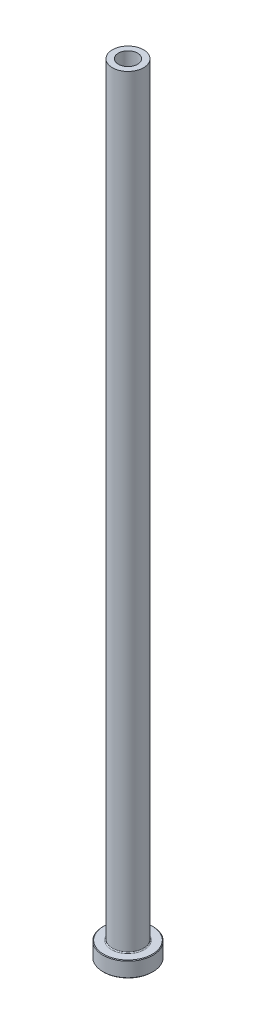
from build123d import *

# Parameters (mm, degrees)
FILLET1_R     = 0.3
CHAMFER1_SIZE = 0.2
CHAMFER3_SIZE = 0.5


with BuildPart() as part:
    # Sketch1 → Revolve1 (revolve)
    with BuildSketch(Plane.XY, mode=Mode.PRIVATE) as revolve1_sk:
        Polygon((-3.1, 250), (-5, 250), (-5, 5), (-8, 5), (-8, 0), (-3.35, 0), (-3.35, 193), (-3.1, 205), align=None)
    revolve(revolve1_sk.sketch.rotate(Axis((0, 92.187680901, 0), (0, -1, 0)), 270), axis=Axis((0, 92.187680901, 0), (0, -1, 0)))

    # Fillet1
    fillet1_edges = [part.edges().sort_by_distance(p)[0] for p in [
        (0, 5, -5),
    ]]
    fillet(fillet1_edges, radius=FILLET1_R)

    # Chamfer1
    chamfer1_edges = [part.edges().sort_by_distance(p)[0] for p in [
        (0, 0, -8),
        (0, 5, -8),
    ]]
    chamfer(chamfer1_edges, length=CHAMFER1_SIZE)

    # Chamfer3
    chamfer3_edges = [part.edges().sort_by_distance(p)[0] for p in [
        (0, 0, -3.35),
    ]]
    chamfer(chamfer3_edges, length=CHAMFER3_SIZE)


solid = part.part
